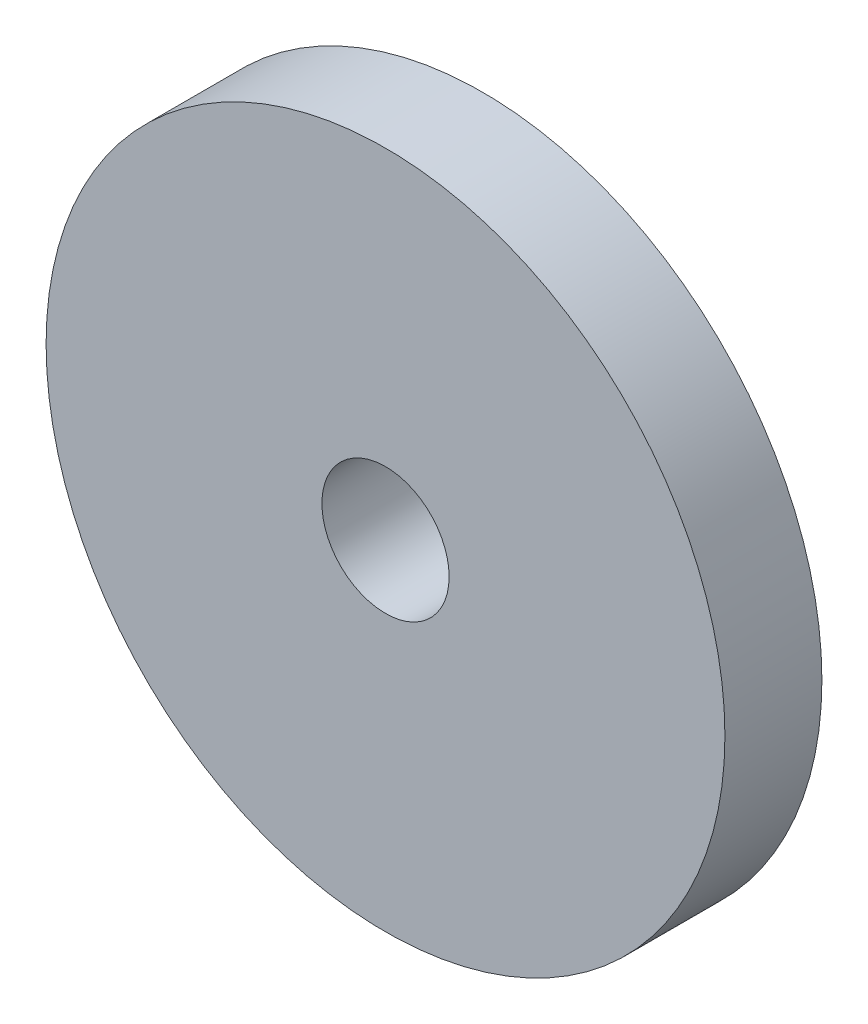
ISO-10303-21;
HEADER;
FILE_DESCRIPTION(('STEP AP214'),'2;1');
FILE_NAME('part.step','',(''),(''),'','','');
FILE_SCHEMA(('AUTOMOTIVE_DESIGN { 1 0 10303 214 1 1 1 1 }'));
ENDSEC;
DATA;
#1=APPLICATION_CONTEXT('core data for automotive mechanical design processes');
#2=APPLICATION_PROTOCOL_DEFINITION('international standard','automotive_design',2000,#1);
#3=PRODUCT_CONTEXT('',#1,'mechanical');
#4=PRODUCT('Part','Part','',(#3));
#5=PRODUCT_RELATED_PRODUCT_CATEGORY('part','',(#4));
#6=PRODUCT_DEFINITION_FORMATION('','',#4);
#7=PRODUCT_DEFINITION_CONTEXT('part definition',#1,'design');
#8=PRODUCT_DEFINITION('design','',#6,#7);
#9=PRODUCT_DEFINITION_SHAPE('','',#8);
#10=(LENGTH_UNIT() NAMED_UNIT(*) SI_UNIT(.MILLI.,.METRE.));
#11=(NAMED_UNIT(*) PLANE_ANGLE_UNIT() SI_UNIT($,.RADIAN.));
#12=(NAMED_UNIT(*) SI_UNIT($,.STERADIAN.) SOLID_ANGLE_UNIT());
#13=UNCERTAINTY_MEASURE_WITH_UNIT(LENGTH_MEASURE(1.E-05),#10,'distance_accuracy_value','');
#14=(GEOMETRIC_REPRESENTATION_CONTEXT(3) GLOBAL_UNCERTAINTY_ASSIGNED_CONTEXT((#13)) GLOBAL_UNIT_ASSIGNED_CONTEXT((#10,
#11,#12)) REPRESENTATION_CONTEXT('',''));
#15=CARTESIAN_POINT('',(0.,0.,0.));
#16=DIRECTION('',(0.,0.,1.));
#17=DIRECTION('',(1.,0.,0.));
#18=AXIS2_PLACEMENT_3D('',#15,#16,#17);
#19=CARTESIAN_POINT('',(0.,0.,3.175));
#20=DIRECTION('',(0.,0.,-1.));
#21=DIRECTION('',(-1.,0.,0.));
#22=AXIS2_PLACEMENT_3D('',#19,#20,#21);
#23=CYLINDRICAL_SURFACE('',#22,11.1125);
#24=CARTESIAN_POINT('',(0.,0.,3.175));
#25=DIRECTION('',(0.,0.,1.));
#26=DIRECTION('',(1.,0.,0.));
#27=AXIS2_PLACEMENT_3D('',#24,#25,#26);
#28=CIRCLE('',#27,11.1125);
#29=CARTESIAN_POINT('',(11.1125,0.,3.175));
#30=VERTEX_POINT('',#29);
#31=EDGE_CURVE('E10',#30,#30,#28,.T.);
#32=ORIENTED_EDGE('',*,*,#31,.F.);
#33=EDGE_LOOP('',(#32));
#34=FACE_BOUND('',#33,.T.);
#35=CARTESIAN_POINT('',(0.,0.,0.));
#36=DIRECTION('',(0.,0.,1.));
#37=DIRECTION('',(1.,0.,0.));
#38=AXIS2_PLACEMENT_3D('',#35,#36,#37);
#39=CIRCLE('',#38,11.1125);
#40=CARTESIAN_POINT('',(11.1125,0.,0.));
#41=VERTEX_POINT('',#40);
#42=EDGE_CURVE('E33',#41,#41,#39,.T.);
#43=ORIENTED_EDGE('',*,*,#42,.T.);
#44=EDGE_LOOP('',(#43));
#45=FACE_BOUND('',#44,.T.);
#46=ADVANCED_FACE('F30',(#34,#45),#23,.T.);
#47=CARTESIAN_POINT('',(0.,0.,3.175));
#48=DIRECTION('',(0.,0.,1.));
#49=DIRECTION('',(1.,0.,0.));
#50=AXIS2_PLACEMENT_3D('',#47,#48,#49);
#51=PLANE('',#50);
#52=CARTESIAN_POINT('',(0.,0.,3.175));
#53=DIRECTION('',(0.,0.,1.));
#54=DIRECTION('',(1.,0.,0.));
#55=AXIS2_PLACEMENT_3D('',#52,#53,#54);
#56=CIRCLE('',#55,2.0828);
#57=CARTESIAN_POINT('',(2.0828,0.,3.175));
#58=VERTEX_POINT('',#57);
#59=EDGE_CURVE('E42',#58,#58,#56,.T.);
#60=ORIENTED_EDGE('',*,*,#59,.F.);
#61=EDGE_LOOP('',(#60));
#62=FACE_BOUND('',#61,.T.);
#63=ORIENTED_EDGE('',*,*,#31,.T.);
#64=EDGE_LOOP('',(#63));
#65=FACE_BOUND('',#64,.T.);
#66=ADVANCED_FACE('F57',(#62,#65),#51,.T.);
#67=CARTESIAN_POINT('',(0.,0.,0.));
#68=DIRECTION('',(0.,0.,1.));
#69=DIRECTION('',(1.,0.,0.));
#70=AXIS2_PLACEMENT_3D('',#67,#68,#69);
#71=PLANE('',#70);
#72=CARTESIAN_POINT('',(0.,0.,0.));
#73=DIRECTION('',(0.,0.,1.));
#74=DIRECTION('',(1.,0.,0.));
#75=AXIS2_PLACEMENT_3D('',#72,#73,#74);
#76=CIRCLE('',#75,2.0828);
#77=CARTESIAN_POINT('',(2.0828,0.,0.));
#78=VERTEX_POINT('',#77);
#79=EDGE_CURVE('E40',#78,#78,#76,.T.);
#80=ORIENTED_EDGE('',*,*,#79,.T.);
#81=EDGE_LOOP('',(#80));
#82=FACE_BOUND('',#81,.T.);
#83=ORIENTED_EDGE('',*,*,#42,.F.);
#84=EDGE_LOOP('',(#83));
#85=FACE_BOUND('',#84,.T.);
#86=ADVANCED_FACE('F48',(#82,#85),#71,.F.);
#87=CARTESIAN_POINT('',(0.,0.,0.));
#88=DIRECTION('',(0.,0.,1.));
#89=DIRECTION('',(1.,0.,0.));
#90=AXIS2_PLACEMENT_3D('',#87,#88,#89);
#91=CYLINDRICAL_SURFACE('',#90,2.0828);
#92=ORIENTED_EDGE('',*,*,#79,.F.);
#93=EDGE_LOOP('',(#92));
#94=FACE_BOUND('',#93,.T.);
#95=ORIENTED_EDGE('',*,*,#59,.T.);
#96=EDGE_LOOP('',(#95));
#97=FACE_BOUND('',#96,.T.);
#98=ADVANCED_FACE('F51',(#94,#97),#91,.F.);
#99=CLOSED_SHELL('',(#46,#66,#86,#98));
#100=MANIFOLD_SOLID_BREP('B2',#99);
#101=ADVANCED_BREP_SHAPE_REPRESENTATION('',(#18,#100),#14);
#102=SHAPE_DEFINITION_REPRESENTATION(#9,#101);
ENDSEC;
END-ISO-10303-21;
